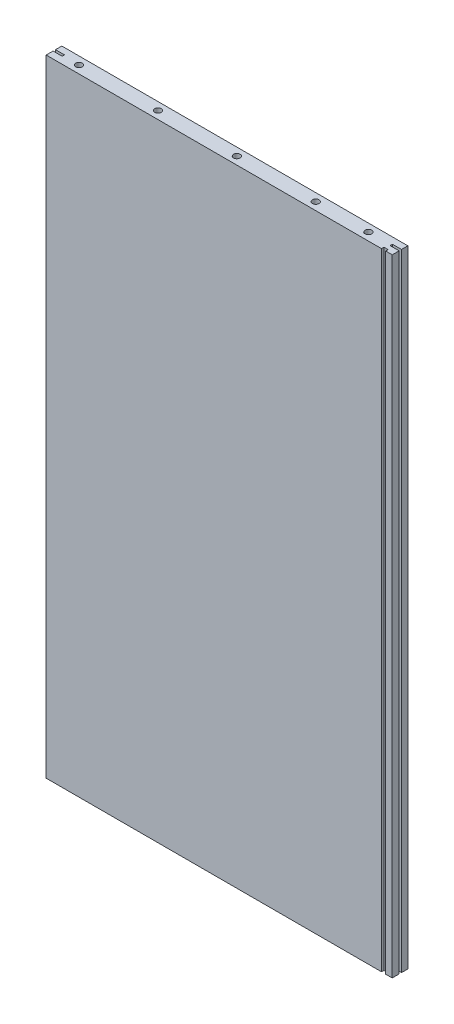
from build123d import *

# Parameters (mm, degrees)
SKIZZE1_W                                     = 421
SKIZZE1_H                                     = 762
AUFSATZ_LINEAR_AUSTRAGEN1_DEPTH               = 19
SKIZZE3_W                                     = 5
SKIZZE3_H                                     = 3
SCHNITT_LINEAR_AUSTRAGEN1_R_CKWANDNUT_DEPTH   = 791.768771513
F_8_0_8_DURCHMESSER_BOHRUNG2_D_BEL_AT_2_COUNT = 2
F_8_0_8_DURCHMESSER_BOHRUNG2_D_BEL_AT_2_PITCH = 64
F_8_0_8_DURCHMESSER_BOHRUNG2_D_BEL_AT_3_COUNT = 2
F_8_0_8_DURCHMESSER_BOHRUNG2_D_BEL_AT_3_PITCH = 160
F_8_0_8_DURCHMESSER_BOHRUNG2_D_BEL_AT_4_COUNT = 2
F_8_0_8_DURCHMESSER_BOHRUNG2_D_BEL_AT_4_PITCH = 256
F_8_0_8_DURCHMESSER_BOHRUNG2_D_BEL_AT_5_COUNT = 2
F_8_0_8_DURCHMESSER_BOHRUNG2_D_BEL_AT_5_PITCH = 352
SKIZZE11_W                                    = 11
SKIZZE11_H                                    = 2.9
SCHNITT_LINEAR_AUSTRAGEN1_DEPTH               = 791.768771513


with BuildPart() as part:
    # Skizze1 → Aufsatz-Linear austragen1 (new body)
    with BuildSketch(Plane.XY):
        Rectangle(SKIZZE1_W, SKIZZE1_H)
    extrude(amount=AUFSATZ_LINEAR_AUSTRAGEN1_DEPTH)

    # Skizze3 → Schnitt-Linear austragen1 R_ckwandnut (cut, through all)
    with BuildSketch(Plane.XZ.offset(381)):
        with Locations((200, 17.5)):
            Rectangle(SKIZZE3_W, SKIZZE3_H)
    extrude(amount=-SCHNITT_LINEAR_AUSTRAGEN1_R_CKWANDNUT_DEPTH, mode=Mode.SUBTRACT)

    # Skizze7 → 8.0 _8_ Durchmesser Bohrung2 D_bel (revolve, cut)
    with BuildSketch(Plane(origin=(172, -381, 9.5), x_dir=(0, 0, -1), z_dir=(1, 0, 0))):
        Polygon((0, 0), (0, 29.403442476), (4, 27), (4, 0), align=None)
    f_8_0_8_durchmesser_bohrung2_d_bel = revolve(axis=Axis((172, -387.35, 9.5), (0, 1, 0)), mode=Mode.SUBTRACT)

    # 8.0 _8_ Durchmesser Bohrung2 D_bel at 2: 8.0 _8_ Durchmesser Bohrung2 D_bel ×2
    with Locations(*[(-i * F_8_0_8_DURCHMESSER_BOHRUNG2_D_BEL_AT_2_PITCH, 0, 0) for i in range(1, F_8_0_8_DURCHMESSER_BOHRUNG2_D_BEL_AT_2_COUNT)]):
        add(f_8_0_8_durchmesser_bohrung2_d_bel, mode=Mode.SUBTRACT)

    # 8.0 _8_ Durchmesser Bohrung2 D_bel at 3: 8.0 _8_ Durchmesser Bohrung2 D_bel ×2
    with Locations(*[(-i * F_8_0_8_DURCHMESSER_BOHRUNG2_D_BEL_AT_3_PITCH, 0, 0) for i in range(1, F_8_0_8_DURCHMESSER_BOHRUNG2_D_BEL_AT_3_COUNT)]):
        add(f_8_0_8_durchmesser_bohrung2_d_bel, mode=Mode.SUBTRACT)

    # 8.0 _8_ Durchmesser Bohrung2 D_bel at 4: 8.0 _8_ Durchmesser Bohrung2 D_bel ×2
    with Locations(*[(-i * F_8_0_8_DURCHMESSER_BOHRUNG2_D_BEL_AT_4_PITCH, 0, 0) for i in range(1, F_8_0_8_DURCHMESSER_BOHRUNG2_D_BEL_AT_4_COUNT)]):
        add(f_8_0_8_durchmesser_bohrung2_d_bel, mode=Mode.SUBTRACT)

    # 8.0 _8_ Durchmesser Bohrung2 D_bel at 5: 8.0 _8_ Durchmesser Bohrung2 D_bel ×2
    with Locations(*[(-i * F_8_0_8_DURCHMESSER_BOHRUNG2_D_BEL_AT_5_PITCH, 0, 0) for i in range(1, F_8_0_8_DURCHMESSER_BOHRUNG2_D_BEL_AT_5_COUNT)]):
        add(f_8_0_8_durchmesser_bohrung2_d_bel, mode=Mode.SUBTRACT)

    # Spiegeln1: 8.0 _8_ Durchmesser Bohrung2 D_bel across plane
    add(f_8_0_8_durchmesser_bohrung2_d_bel.mirror(Plane.ZX), mode=Mode.SUBTRACT)

    # Spiegeln1 copy 1 sketch → Spiegeln1 copy 1 (revolve, cut)
    with BuildSketch(Plane(origin=(108, 381, 9.5), x_dir=(0, 0, -1), z_dir=(1, 0, 0))):
        Polygon((0, 0), (0, -29.403442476), (4, -27), (4, 0), align=None)
    revolve(axis=Axis((108, 387.35, 9.5), (0, 1, 0)), mode=Mode.SUBTRACT)

    # Spiegeln1 copy 2 sketch → Spiegeln1 copy 2 (revolve, cut)
    with BuildSketch(Plane(origin=(12, 381, 9.5), x_dir=(0, 0, -1), z_dir=(1, 0, 0))):
        Polygon((0, 0), (0, -29.403442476), (4, -27), (4, 0), align=None)
    revolve(axis=Axis((12, 387.35, 9.5), (0, 1, 0)), mode=Mode.SUBTRACT)

    # Spiegeln1 copy 3 sketch → Spiegeln1 copy 3 (revolve, cut)
    with BuildSketch(Plane(origin=(-84, 381, 9.5), x_dir=(0, 0, -1), z_dir=(1, 0, 0))):
        Polygon((0, 0), (0, -29.403442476), (4, -27), (4, 0), align=None)
    revolve(axis=Axis((-84, 387.35, 9.5), (0, 1, 0)), mode=Mode.SUBTRACT)

    # Spiegeln1 copy 4 sketch → Spiegeln1 copy 4 (revolve, cut)
    with BuildSketch(Plane(origin=(-180, 381, 9.5), x_dir=(0, 0, -1), z_dir=(1, 0, 0))):
        Polygon((0, 0), (0, -29.403442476), (4, -27), (4, 0), align=None)
    revolve(axis=Axis((-180, 387.35, 9.5), (0, 1, 0)), mode=Mode.SUBTRACT)

    # Skizze11 → Schnitt-Linear austragen1 (cut, through all)
    with BuildSketch(Plane.XZ.offset(381)):
        with Locations((-205, 9.15)):
            Rectangle(SKIZZE11_W, SKIZZE11_H)
    schnitt_linear_austragen1 = extrude(amount=-SCHNITT_LINEAR_AUSTRAGEN1_DEPTH, mode=Mode.SUBTRACT)

    # Spiegeln3: Schnitt-Linear austragen1 across plane
    add(schnitt_linear_austragen1.mirror(Plane(origin=(0, 0, 0), x_dir=(0, 0, 1), z_dir=(1, 0, 0))), mode=Mode.SUBTRACT)


solid = part.part
